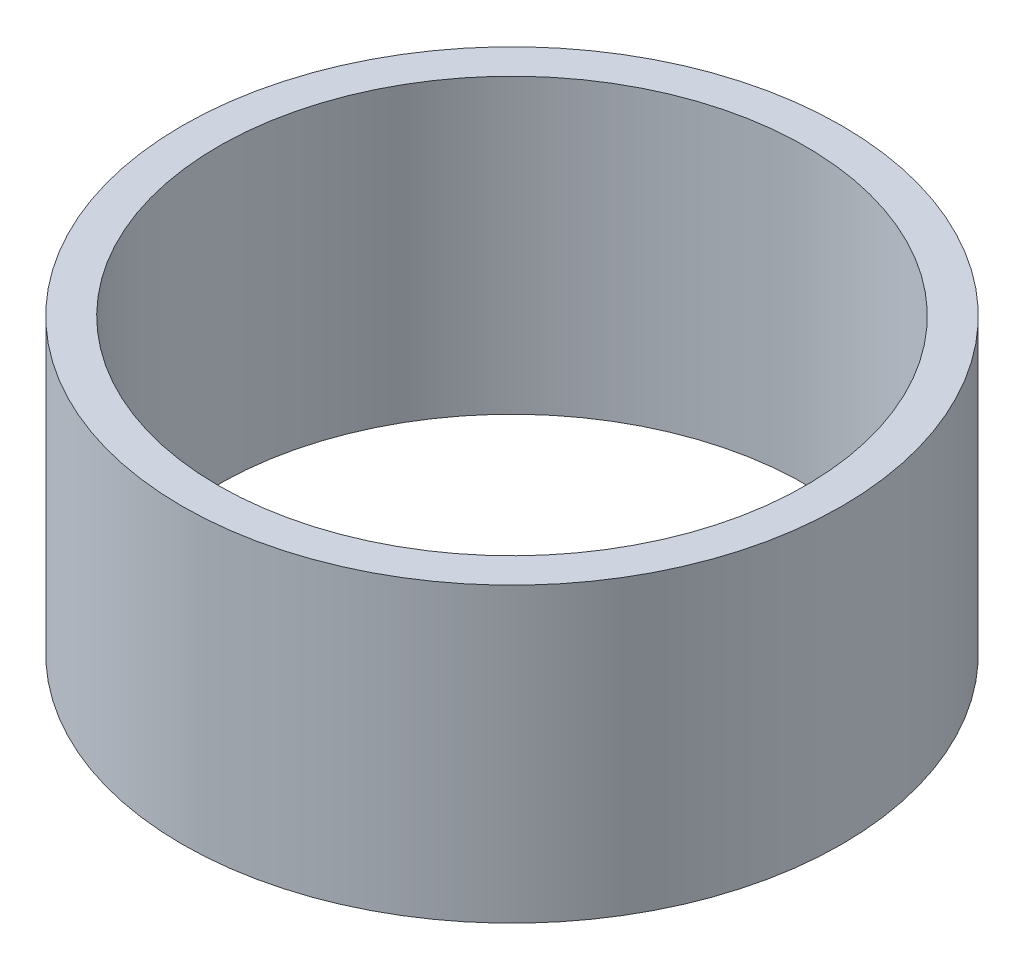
from build123d import *

# Parameters (mm, degrees)
SKETCH1_R           = 71.515755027
BOSS_EXTRUDE1_DEPTH = 63.5
SKETCH2_R           = 63.7032
CUT_EXTRUDE1_DEPTH  = 120.420502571


with BuildPart() as part:
    # Sketch1 → Boss-Extrude1 (new body)
    with BuildSketch(Plane(origin=(0, 0, 0), x_dir=(1, 0, 0), z_dir=(0, 1, 0))):
        with Locations(Location((0, 0, 0), (0, 0, 270))):
            Circle(SKETCH1_R)
    extrude(amount=BOSS_EXTRUDE1_DEPTH)

    # Sketch2 → Cut-Extrude1 (cut, through all)
    with BuildSketch(Plane(origin=(0, 63.5, 0), x_dir=(1, 0, 0), z_dir=(0, 1, 0))):
        with Locations(Location((0, 0, 0), (0, 0, 270))):
            Circle(SKETCH2_R)
    extrude(amount=-CUT_EXTRUDE1_DEPTH, mode=Mode.SUBTRACT)


solid = part.part
